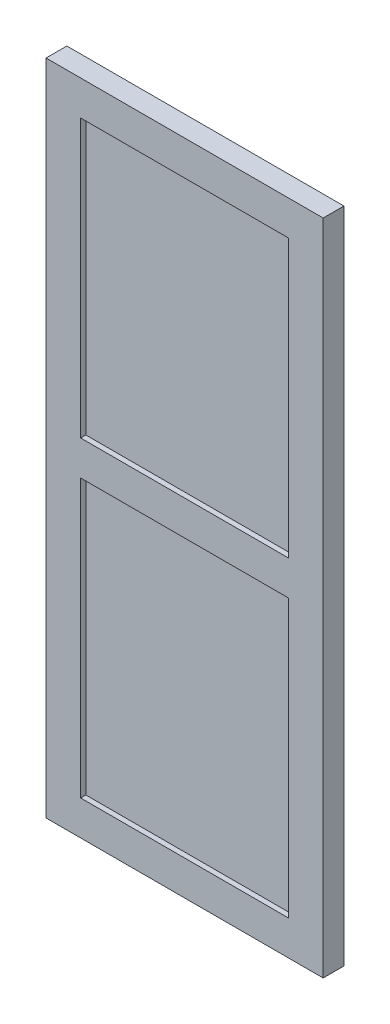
ISO-10303-21;
HEADER;
FILE_DESCRIPTION(('STEP AP214'),'2;1');
FILE_NAME('part.step','',(''),(''),'','','');
FILE_SCHEMA(('AUTOMOTIVE_DESIGN { 1 0 10303 214 1 1 1 1 }'));
ENDSEC;
DATA;
#1=APPLICATION_CONTEXT('core data for automotive mechanical design processes');
#2=APPLICATION_PROTOCOL_DEFINITION('international standard','automotive_design',2000,#1);
#3=PRODUCT_CONTEXT('',#1,'mechanical');
#4=PRODUCT('Part','Part','',(#3));
#5=PRODUCT_RELATED_PRODUCT_CATEGORY('part','',(#4));
#6=PRODUCT_DEFINITION_FORMATION('','',#4);
#7=PRODUCT_DEFINITION_CONTEXT('part definition',#1,'design');
#8=PRODUCT_DEFINITION('design','',#6,#7);
#9=PRODUCT_DEFINITION_SHAPE('','',#8);
#10=(LENGTH_UNIT() NAMED_UNIT(*) SI_UNIT(.MILLI.,.METRE.));
#11=(NAMED_UNIT(*) PLANE_ANGLE_UNIT() SI_UNIT($,.RADIAN.));
#12=(NAMED_UNIT(*) SI_UNIT($,.STERADIAN.) SOLID_ANGLE_UNIT());
#13=UNCERTAINTY_MEASURE_WITH_UNIT(LENGTH_MEASURE(1.E-05),#10,'distance_accuracy_value','');
#14=(GEOMETRIC_REPRESENTATION_CONTEXT(3) GLOBAL_UNCERTAINTY_ASSIGNED_CONTEXT((#13)) GLOBAL_UNIT_ASSIGNED_CONTEXT((#10,
#11,#12)) REPRESENTATION_CONTEXT('',''));
#15=CARTESIAN_POINT('',(0.,0.,0.));
#16=DIRECTION('',(0.,0.,1.));
#17=DIRECTION('',(1.,0.,0.));
#18=AXIS2_PLACEMENT_3D('',#15,#16,#17);
#19=CARTESIAN_POINT('',(111.647727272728,-90.4829545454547,-30.));
#20=DIRECTION('',(1.,0.,0.));
#21=DIRECTION('',(0.,1.,0.));
#22=AXIS2_PLACEMENT_3D('',#19,#20,#21);
#23=PLANE('',#22);
#24=DIRECTION('',(0.,-1.,0.));
#25=VECTOR('',#24,1.);
#26=CARTESIAN_POINT('',(111.647727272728,0.,-15.));
#27=LINE('',#26,#25);
#28=CARTESIAN_POINT('',(111.647727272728,-90.4829545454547,-15.));
#29=VERTEX_POINT('',#28);
#30=CARTESIAN_POINT('',(111.647727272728,-890.482954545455,-15.));
#31=VERTEX_POINT('',#30);
#32=EDGE_CURVE('E355',#29,#31,#27,.T.);
#33=ORIENTED_EDGE('',*,*,#32,.F.);
#34=DIRECTION('',(0.,0.,1.));
#35=VECTOR('',#34,1.);
#36=CARTESIAN_POINT('',(111.647727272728,-90.4829545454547,-30.));
#37=LINE('',#36,#35);
#38=CARTESIAN_POINT('',(111.647727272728,-90.4829545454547,-30.));
#39=VERTEX_POINT('',#38);
#40=EDGE_CURVE('E195',#39,#29,#37,.T.);
#41=ORIENTED_EDGE('',*,*,#40,.F.);
#42=DIRECTION('',(0.,1.,0.));
#43=VECTOR('',#42,1.);
#44=CARTESIAN_POINT('',(111.647727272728,-90.4829545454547,-30.));
#45=LINE('',#44,#43);
#46=CARTESIAN_POINT('',(111.647727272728,-890.482954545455,-30.));
#47=VERTEX_POINT('',#46);
#48=EDGE_CURVE('E274',#47,#39,#45,.T.);
#49=ORIENTED_EDGE('',*,*,#48,.F.);
#50=DIRECTION('',(0.,0.,1.));
#51=VECTOR('',#50,1.);
#52=CARTESIAN_POINT('',(111.647727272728,-890.482954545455,-30.));
#53=LINE('',#52,#51);
#54=EDGE_CURVE('E207',#47,#31,#53,.T.);
#55=ORIENTED_EDGE('',*,*,#54,.T.);
#56=EDGE_LOOP('',(#33,#41,#49,#55));
#57=FACE_BOUND('',#56,.T.);
#58=ADVANCED_FACE('F32',(#57),#23,.F.);
#59=CARTESIAN_POINT('',(-488.352272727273,-890.482954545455,-30.));
#60=DIRECTION('',(0.,-1.,0.));
#61=DIRECTION('',(1.,0.,0.));
#62=AXIS2_PLACEMENT_3D('',#59,#60,#61);
#63=PLANE('',#62);
#64=DIRECTION('',(1.,0.,0.));
#65=VECTOR('',#64,1.);
#66=CARTESIAN_POINT('',(1.64772446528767E-13,-890.482954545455,-15.));
#67=LINE('',#66,#65);
#68=CARTESIAN_POINT('',(-488.352272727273,-890.482954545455,-15.));
#69=VERTEX_POINT('',#68);
#70=EDGE_CURVE('E49',#69,#31,#67,.T.);
#71=ORIENTED_EDGE('',*,*,#70,.T.);
#72=ORIENTED_EDGE('',*,*,#54,.F.);
#73=DIRECTION('',(1.,0.,0.));
#74=VECTOR('',#73,1.);
#75=CARTESIAN_POINT('',(-488.352272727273,-890.482954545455,-30.));
#76=LINE('',#75,#74);
#77=CARTESIAN_POINT('',(-488.352272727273,-890.482954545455,-30.));
#78=VERTEX_POINT('',#77);
#79=EDGE_CURVE('E283',#78,#47,#76,.T.);
#80=ORIENTED_EDGE('',*,*,#79,.F.);
#81=DIRECTION('',(0.,0.,1.));
#82=VECTOR('',#81,1.);
#83=CARTESIAN_POINT('',(-488.352272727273,-890.482954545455,-30.));
#84=LINE('',#83,#82);
#85=EDGE_CURVE('E200',#78,#69,#84,.T.);
#86=ORIENTED_EDGE('',*,*,#85,.T.);
#87=EDGE_LOOP('',(#71,#72,#80,#86));
#88=FACE_BOUND('',#87,.T.);
#89=ADVANCED_FACE('F382',(#88),#63,.F.);
#90=CARTESIAN_POINT('',(-488.352272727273,-90.4829545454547,-30.));
#91=DIRECTION('',(-1.,0.,0.));
#92=DIRECTION('',(0.,0.,1.));
#93=AXIS2_PLACEMENT_3D('',#90,#91,#92);
#94=PLANE('',#93);
#95=DIRECTION('',(0.,-1.,0.));
#96=VECTOR('',#95,1.);
#97=CARTESIAN_POINT('',(-488.352272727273,0.,-15.));
#98=LINE('',#97,#96);
#99=CARTESIAN_POINT('',(-488.352272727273,-90.4829545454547,-15.));
#100=VERTEX_POINT('',#99);
#101=EDGE_CURVE('E57',#100,#69,#98,.T.);
#102=ORIENTED_EDGE('',*,*,#101,.T.);
#103=ORIENTED_EDGE('',*,*,#85,.F.);
#104=DIRECTION('',(0.,-1.,0.));
#105=VECTOR('',#104,1.);
#106=CARTESIAN_POINT('',(-488.352272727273,-90.4829545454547,-30.));
#107=LINE('',#106,#105);
#108=CARTESIAN_POINT('',(-488.352272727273,-90.4829545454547,-30.));
#109=VERTEX_POINT('',#108);
#110=EDGE_CURVE('E280',#109,#78,#107,.T.);
#111=ORIENTED_EDGE('',*,*,#110,.F.);
#112=DIRECTION('',(0.,0.,1.));
#113=VECTOR('',#112,1.);
#114=CARTESIAN_POINT('',(-488.352272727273,-90.4829545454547,-30.));
#115=LINE('',#114,#113);
#116=EDGE_CURVE('E194',#109,#100,#115,.T.);
#117=ORIENTED_EDGE('',*,*,#116,.T.);
#118=EDGE_LOOP('',(#102,#103,#111,#117));
#119=FACE_BOUND('',#118,.T.);
#120=ADVANCED_FACE('F387',(#119),#94,.F.);
#121=CARTESIAN_POINT('',(-488.352272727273,-90.4829545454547,-30.));
#122=DIRECTION('',(0.,1.,0.));
#123=DIRECTION('',(0.,0.,1.));
#124=AXIS2_PLACEMENT_3D('',#121,#122,#123);
#125=PLANE('',#124);
#126=DIRECTION('',(1.,0.,0.));
#127=VECTOR('',#126,1.);
#128=CARTESIAN_POINT('',(0.,-90.4829545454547,-15.));
#129=LINE('',#128,#127);
#130=EDGE_CURVE('E347',#100,#29,#129,.T.);
#131=ORIENTED_EDGE('',*,*,#130,.F.);
#132=ORIENTED_EDGE('',*,*,#116,.F.);
#133=DIRECTION('',(-1.,0.,0.));
#134=VECTOR('',#133,1.);
#135=CARTESIAN_POINT('',(-488.352272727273,-90.4829545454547,-30.));
#136=LINE('',#135,#134);
#137=EDGE_CURVE('E277',#39,#109,#136,.T.);
#138=ORIENTED_EDGE('',*,*,#137,.F.);
#139=ORIENTED_EDGE('',*,*,#40,.T.);
#140=EDGE_LOOP('',(#131,#132,#138,#139));
#141=FACE_BOUND('',#140,.T.);
#142=ADVANCED_FACE('F379',(#141),#125,.F.);
#143=CARTESIAN_POINT('',(-488.352272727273,809.517045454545,-30.));
#144=DIRECTION('',(-1.,0.,0.));
#145=DIRECTION('',(0.,0.,1.));
#146=AXIS2_PLACEMENT_3D('',#143,#144,#145);
#147=PLANE('',#146);
#148=DIRECTION('',(0.,-1.,0.));
#149=VECTOR('',#148,1.);
#150=CARTESIAN_POINT('',(-488.352272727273,0.,-15.));
#151=LINE('',#150,#149);
#152=CARTESIAN_POINT('',(-488.352272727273,809.517045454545,-15.));
#153=VERTEX_POINT('',#152);
#154=CARTESIAN_POINT('',(-488.352272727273,9.51704545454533,-15.));
#155=VERTEX_POINT('',#154);
#156=EDGE_CURVE('E329',#153,#155,#151,.T.);
#157=ORIENTED_EDGE('',*,*,#156,.T.);
#158=DIRECTION('',(0.,0.,1.));
#159=VECTOR('',#158,1.);
#160=CARTESIAN_POINT('',(-488.352272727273,9.51704545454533,-30.));
#161=LINE('',#160,#159);
#162=CARTESIAN_POINT('',(-488.352272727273,9.51704545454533,-30.));
#163=VERTEX_POINT('',#162);
#164=EDGE_CURVE('E230',#163,#155,#161,.T.);
#165=ORIENTED_EDGE('',*,*,#164,.F.);
#166=DIRECTION('',(0.,-1.,0.));
#167=VECTOR('',#166,1.);
#168=CARTESIAN_POINT('',(-488.352272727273,809.517045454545,-30.));
#169=LINE('',#168,#167);
#170=CARTESIAN_POINT('',(-488.352272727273,809.517045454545,-30.));
#171=VERTEX_POINT('',#170);
#172=EDGE_CURVE('E203',#171,#163,#169,.T.);
#173=ORIENTED_EDGE('',*,*,#172,.F.);
#174=DIRECTION('',(0.,0.,1.));
#175=VECTOR('',#174,1.);
#176=CARTESIAN_POINT('',(-488.352272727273,809.517045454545,-30.));
#177=LINE('',#176,#175);
#178=EDGE_CURVE('E217',#171,#153,#177,.T.);
#179=ORIENTED_EDGE('',*,*,#178,.T.);
#180=EDGE_LOOP('',(#157,#165,#173,#179));
#181=FACE_BOUND('',#180,.T.);
#182=ADVANCED_FACE('F368',(#181),#147,.F.);
#183=CARTESIAN_POINT('',(-488.352272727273,809.517045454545,-30.));
#184=DIRECTION('',(0.,1.,0.));
#185=DIRECTION('',(0.,0.,1.));
#186=AXIS2_PLACEMENT_3D('',#183,#184,#185);
#187=PLANE('',#186);
#188=DIRECTION('',(1.,0.,0.));
#189=VECTOR('',#188,1.);
#190=CARTESIAN_POINT('',(0.,809.517045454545,-15.));
#191=LINE('',#190,#189);
#192=CARTESIAN_POINT('',(111.647727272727,809.517045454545,-15.));
#193=VERTEX_POINT('',#192);
#194=EDGE_CURVE('E343',#153,#193,#191,.T.);
#195=ORIENTED_EDGE('',*,*,#194,.F.);
#196=ORIENTED_EDGE('',*,*,#178,.F.);
#197=DIRECTION('',(-1.,0.,0.));
#198=VECTOR('',#197,1.);
#199=CARTESIAN_POINT('',(-488.352272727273,809.517045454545,-30.));
#200=LINE('',#199,#198);
#201=CARTESIAN_POINT('',(111.647727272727,809.517045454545,-30.));
#202=VERTEX_POINT('',#201);
#203=EDGE_CURVE('E213',#202,#171,#200,.T.);
#204=ORIENTED_EDGE('',*,*,#203,.F.);
#205=DIRECTION('',(0.,0.,1.));
#206=VECTOR('',#205,1.);
#207=CARTESIAN_POINT('',(111.647727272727,809.517045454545,-30.));
#208=LINE('',#207,#206);
#209=EDGE_CURVE('E222',#202,#193,#208,.T.);
#210=ORIENTED_EDGE('',*,*,#209,.T.);
#211=EDGE_LOOP('',(#195,#196,#204,#210));
#212=FACE_BOUND('',#211,.T.);
#213=ADVANCED_FACE('F374',(#212),#187,.F.);
#214=CARTESIAN_POINT('',(111.647727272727,809.517045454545,-30.));
#215=DIRECTION('',(1.,0.,0.));
#216=DIRECTION('',(0.,1.,0.));
#217=AXIS2_PLACEMENT_3D('',#214,#215,#216);
#218=PLANE('',#217);
#219=DIRECTION('',(0.,-1.,0.));
#220=VECTOR('',#219,1.);
#221=CARTESIAN_POINT('',(111.647727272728,0.,-15.));
#222=LINE('',#221,#220);
#223=CARTESIAN_POINT('',(111.647727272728,9.51704545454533,-15.));
#224=VERTEX_POINT('',#223);
#225=EDGE_CURVE('E340',#193,#224,#222,.T.);
#226=ORIENTED_EDGE('',*,*,#225,.F.);
#227=ORIENTED_EDGE('',*,*,#209,.F.);
#228=DIRECTION('',(0.,1.,0.));
#229=VECTOR('',#228,1.);
#230=CARTESIAN_POINT('',(111.647727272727,809.517045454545,-30.));
#231=LINE('',#230,#229);
#232=CARTESIAN_POINT('',(111.647727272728,9.51704545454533,-30.));
#233=VERTEX_POINT('',#232);
#234=EDGE_CURVE('E210',#233,#202,#231,.T.);
#235=ORIENTED_EDGE('',*,*,#234,.F.);
#236=DIRECTION('',(0.,0.,1.));
#237=VECTOR('',#236,1.);
#238=CARTESIAN_POINT('',(111.647727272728,9.51704545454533,-30.));
#239=LINE('',#238,#237);
#240=EDGE_CURVE('E226',#233,#224,#239,.T.);
#241=ORIENTED_EDGE('',*,*,#240,.T.);
#242=EDGE_LOOP('',(#226,#227,#235,#241));
#243=FACE_BOUND('',#242,.T.);
#244=ADVANCED_FACE('F400',(#243),#218,.F.);
#245=CARTESIAN_POINT('',(-488.352272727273,9.51704545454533,-30.));
#246=DIRECTION('',(0.,-1.,0.));
#247=DIRECTION('',(1.,0.,0.));
#248=AXIS2_PLACEMENT_3D('',#245,#246,#247);
#249=PLANE('',#248);
#250=DIRECTION('',(1.,0.,0.));
#251=VECTOR('',#250,1.);
#252=CARTESIAN_POINT('',(0.,9.51704545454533,-15.));
#253=LINE('',#252,#251);
#254=EDGE_CURVE('E333',#155,#224,#253,.T.);
#255=ORIENTED_EDGE('',*,*,#254,.T.);
#256=ORIENTED_EDGE('',*,*,#240,.F.);
#257=DIRECTION('',(1.,0.,0.));
#258=VECTOR('',#257,1.);
#259=CARTESIAN_POINT('',(-488.352272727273,9.51704545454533,-30.));
#260=LINE('',#259,#258);
#261=EDGE_CURVE('E206',#163,#233,#260,.T.);
#262=ORIENTED_EDGE('',*,*,#261,.F.);
#263=ORIENTED_EDGE('',*,*,#164,.T.);
#264=EDGE_LOOP('',(#255,#256,#262,#263));
#265=FACE_BOUND('',#264,.T.);
#266=ADVANCED_FACE('F395',(#265),#249,.F.);
#267=CARTESIAN_POINT('',(-588.352272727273,909.517045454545,-30.));
#268=DIRECTION('',(-1.,0.,0.));
#269=DIRECTION('',(0.,0.,1.));
#270=AXIS2_PLACEMENT_3D('',#267,#268,#269);
#271=PLANE('',#270);
#272=DIRECTION('',(0.,0.,1.));
#273=VECTOR('',#272,1.);
#274=CARTESIAN_POINT('',(-588.352272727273,-990.482954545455,-30.));
#275=LINE('',#274,#273);
#276=CARTESIAN_POINT('',(-588.352272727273,-990.482954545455,-30.));
#277=VERTEX_POINT('',#276);
#278=CARTESIAN_POINT('',(-588.352272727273,-990.482954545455,30.));
#279=VERTEX_POINT('',#278);
#280=EDGE_CURVE('E36',#277,#279,#275,.T.);
#281=ORIENTED_EDGE('',*,*,#280,.T.);
#282=DIRECTION('',(0.,-1.,0.));
#283=VECTOR('',#282,1.);
#284=CARTESIAN_POINT('',(-588.352272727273,909.517045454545,30.));
#285=LINE('',#284,#283);
#286=CARTESIAN_POINT('',(-588.352272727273,909.517045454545,30.));
#287=VERTEX_POINT('',#286);
#288=EDGE_CURVE('E250',#287,#279,#285,.T.);
#289=ORIENTED_EDGE('',*,*,#288,.F.);
#290=DIRECTION('',(0.,0.,1.));
#291=VECTOR('',#290,1.);
#292=CARTESIAN_POINT('',(-588.352272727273,909.517045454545,-30.));
#293=LINE('',#292,#291);
#294=CARTESIAN_POINT('',(-588.352272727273,909.517045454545,-30.));
#295=VERTEX_POINT('',#294);
#296=EDGE_CURVE('E11',#295,#287,#293,.T.);
#297=ORIENTED_EDGE('',*,*,#296,.F.);
#298=DIRECTION('',(0.,-1.,0.));
#299=VECTOR('',#298,1.);
#300=CARTESIAN_POINT('',(-588.352272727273,909.517045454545,-30.));
#301=LINE('',#300,#299);
#302=EDGE_CURVE('E220',#295,#277,#301,.T.);
#303=ORIENTED_EDGE('',*,*,#302,.T.);
#304=EDGE_LOOP('',(#281,#289,#297,#303));
#305=FACE_BOUND('',#304,.T.);
#306=ADVANCED_FACE('F34',(#305),#271,.T.);
#307=CARTESIAN_POINT('',(-588.352272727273,909.517045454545,-30.));
#308=DIRECTION('',(0.,1.,0.));
#309=DIRECTION('',(0.,0.,1.));
#310=AXIS2_PLACEMENT_3D('',#307,#308,#309);
#311=PLANE('',#310);
#312=ORIENTED_EDGE('',*,*,#296,.T.);
#313=DIRECTION('',(-1.,0.,0.));
#314=VECTOR('',#313,1.);
#315=CARTESIAN_POINT('',(-588.352272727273,909.517045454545,30.));
#316=LINE('',#315,#314);
#317=CARTESIAN_POINT('',(211.647727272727,909.517045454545,30.));
#318=VERTEX_POINT('',#317);
#319=EDGE_CURVE('E264',#318,#287,#316,.T.);
#320=ORIENTED_EDGE('',*,*,#319,.F.);
#321=DIRECTION('',(0.,0.,1.));
#322=VECTOR('',#321,1.);
#323=CARTESIAN_POINT('',(211.647727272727,909.517045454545,-30.));
#324=LINE('',#323,#322);
#325=CARTESIAN_POINT('',(211.647727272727,909.517045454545,-30.));
#326=VERTEX_POINT('',#325);
#327=EDGE_CURVE('E41',#326,#318,#324,.T.);
#328=ORIENTED_EDGE('',*,*,#327,.F.);
#329=DIRECTION('',(-1.,0.,0.));
#330=VECTOR('',#329,1.);
#331=CARTESIAN_POINT('',(-588.352272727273,909.517045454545,-30.));
#332=LINE('',#331,#330);
#333=EDGE_CURVE('E240',#326,#295,#332,.T.);
#334=ORIENTED_EDGE('',*,*,#333,.T.);
#335=EDGE_LOOP('',(#312,#320,#328,#334));
#336=FACE_BOUND('',#335,.T.);
#337=ADVANCED_FACE('F407',(#336),#311,.T.);
#338=CARTESIAN_POINT('',(211.647727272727,909.517045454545,-30.));
#339=DIRECTION('',(1.,0.,0.));
#340=DIRECTION('',(0.,1.,0.));
#341=AXIS2_PLACEMENT_3D('',#338,#339,#340);
#342=PLANE('',#341);
#343=ORIENTED_EDGE('',*,*,#327,.T.);
#344=DIRECTION('',(0.,1.,0.));
#345=VECTOR('',#344,1.);
#346=CARTESIAN_POINT('',(211.647727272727,909.517045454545,30.));
#347=LINE('',#346,#345);
#348=CARTESIAN_POINT('',(211.647727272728,-990.482954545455,30.));
#349=VERTEX_POINT('',#348);
#350=EDGE_CURVE('E258',#349,#318,#347,.T.);
#351=ORIENTED_EDGE('',*,*,#350,.F.);
#352=DIRECTION('',(0.,0.,1.));
#353=VECTOR('',#352,1.);
#354=CARTESIAN_POINT('',(211.647727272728,-990.482954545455,-30.));
#355=LINE('',#354,#353);
#356=CARTESIAN_POINT('',(211.647727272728,-990.482954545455,-30.));
#357=VERTEX_POINT('',#356);
#358=EDGE_CURVE('E243',#357,#349,#355,.T.);
#359=ORIENTED_EDGE('',*,*,#358,.F.);
#360=DIRECTION('',(0.,1.,0.));
#361=VECTOR('',#360,1.);
#362=CARTESIAN_POINT('',(211.647727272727,909.517045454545,-30.));
#363=LINE('',#362,#361);
#364=EDGE_CURVE('E237',#357,#326,#363,.T.);
#365=ORIENTED_EDGE('',*,*,#364,.T.);
#366=EDGE_LOOP('',(#343,#351,#359,#365));
#367=FACE_BOUND('',#366,.T.);
#368=ADVANCED_FACE('F424',(#367),#342,.T.);
#369=CARTESIAN_POINT('',(-588.352272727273,-990.482954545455,-30.));
#370=DIRECTION('',(0.,-1.,0.));
#371=DIRECTION('',(1.,0.,0.));
#372=AXIS2_PLACEMENT_3D('',#369,#370,#371);
#373=PLANE('',#372);
#374=ORIENTED_EDGE('',*,*,#358,.T.);
#375=DIRECTION('',(1.,0.,0.));
#376=VECTOR('',#375,1.);
#377=CARTESIAN_POINT('',(-588.352272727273,-990.482954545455,30.));
#378=LINE('',#377,#376);
#379=EDGE_CURVE('E253',#279,#349,#378,.T.);
#380=ORIENTED_EDGE('',*,*,#379,.F.);
#381=ORIENTED_EDGE('',*,*,#280,.F.);
#382=DIRECTION('',(1.,0.,0.));
#383=VECTOR('',#382,1.);
#384=CARTESIAN_POINT('',(-588.352272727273,-990.482954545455,-30.));
#385=LINE('',#384,#383);
#386=EDGE_CURVE('E234',#277,#357,#385,.T.);
#387=ORIENTED_EDGE('',*,*,#386,.T.);
#388=EDGE_LOOP('',(#374,#380,#381,#387));
#389=FACE_BOUND('',#388,.T.);
#390=ADVANCED_FACE('F254',(#389),#373,.T.);
#391=CARTESIAN_POINT('',(0.,0.,-30.));
#392=DIRECTION('',(0.,0.,1.));
#393=DIRECTION('',(1.,0.,0.));
#394=AXIS2_PLACEMENT_3D('',#391,#392,#393);
#395=PLANE('',#394);
#396=ORIENTED_EDGE('',*,*,#79,.T.);
#397=ORIENTED_EDGE('',*,*,#48,.T.);
#398=ORIENTED_EDGE('',*,*,#137,.T.);
#399=ORIENTED_EDGE('',*,*,#110,.T.);
#400=EDGE_LOOP('',(#396,#397,#398,#399));
#401=FACE_BOUND('',#400,.T.);
#402=ORIENTED_EDGE('',*,*,#203,.T.);
#403=ORIENTED_EDGE('',*,*,#172,.T.);
#404=ORIENTED_EDGE('',*,*,#261,.T.);
#405=ORIENTED_EDGE('',*,*,#234,.T.);
#406=EDGE_LOOP('',(#402,#403,#404,#405));
#407=FACE_BOUND('',#406,.T.);
#408=ORIENTED_EDGE('',*,*,#302,.F.);
#409=ORIENTED_EDGE('',*,*,#333,.F.);
#410=ORIENTED_EDGE('',*,*,#364,.F.);
#411=ORIENTED_EDGE('',*,*,#386,.F.);
#412=EDGE_LOOP('',(#408,#409,#410,#411));
#413=FACE_BOUND('',#412,.T.);
#414=ADVANCED_FACE('F366',(#401,#407,#413),#395,.F.);
#415=CARTESIAN_POINT('',(-488.352272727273,9.51704545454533,15.));
#416=VERTEX_POINT('',#415);
#417=CARTESIAN_POINT('',(-488.352272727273,9.51704545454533,30.));
#418=VERTEX_POINT('',#417);
#419=EDGE_CURVE('E216',#416,#418,#161,.T.);
#420=ORIENTED_EDGE('',*,*,#419,.F.);
#421=DIRECTION('',(0.,-1.,0.));
#422=VECTOR('',#421,1.);
#423=CARTESIAN_POINT('',(-488.352272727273,0.,15.));
#424=LINE('',#423,#422);
#425=CARTESIAN_POINT('',(-488.352272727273,809.517045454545,15.));
#426=VERTEX_POINT('',#425);
#427=EDGE_CURVE('E357',#426,#416,#424,.T.);
#428=ORIENTED_EDGE('',*,*,#427,.F.);
#429=CARTESIAN_POINT('',(-488.352272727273,809.517045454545,30.));
#430=VERTEX_POINT('',#429);
#431=EDGE_CURVE('E221',#426,#430,#177,.T.);
#432=ORIENTED_EDGE('',*,*,#431,.T.);
#433=DIRECTION('',(0.,-1.,0.));
#434=VECTOR('',#433,1.);
#435=CARTESIAN_POINT('',(-488.352272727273,809.517045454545,30.));
#436=LINE('',#435,#434);
#437=EDGE_CURVE('E304',#430,#418,#436,.T.);
#438=ORIENTED_EDGE('',*,*,#437,.T.);
#439=EDGE_LOOP('',(#420,#428,#432,#438));
#440=FACE_BOUND('',#439,.T.);
#441=ADVANCED_FACE('F364',(#440),#147,.F.);
#442=ORIENTED_EDGE('',*,*,#431,.F.);
#443=DIRECTION('',(1.,0.,0.));
#444=VECTOR('',#443,1.);
#445=CARTESIAN_POINT('',(0.,809.517045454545,15.));
#446=LINE('',#445,#444);
#447=CARTESIAN_POINT('',(111.647727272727,809.517045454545,15.));
#448=VERTEX_POINT('',#447);
#449=EDGE_CURVE('E326',#426,#448,#446,.T.);
#450=ORIENTED_EDGE('',*,*,#449,.T.);
#451=CARTESIAN_POINT('',(111.647727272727,809.517045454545,30.));
#452=VERTEX_POINT('',#451);
#453=EDGE_CURVE('E225',#448,#452,#208,.T.);
#454=ORIENTED_EDGE('',*,*,#453,.T.);
#455=DIRECTION('',(-1.,0.,0.));
#456=VECTOR('',#455,1.);
#457=CARTESIAN_POINT('',(-488.352272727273,809.517045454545,30.));
#458=LINE('',#457,#456);
#459=EDGE_CURVE('E265',#452,#430,#458,.T.);
#460=ORIENTED_EDGE('',*,*,#459,.T.);
#461=EDGE_LOOP('',(#442,#450,#454,#460));
#462=FACE_BOUND('',#461,.T.);
#463=ADVANCED_FACE('F324',(#462),#187,.F.);
#464=ORIENTED_EDGE('',*,*,#453,.F.);
#465=DIRECTION('',(0.,-1.,0.));
#466=VECTOR('',#465,1.);
#467=CARTESIAN_POINT('',(111.647727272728,0.,15.));
#468=LINE('',#467,#466);
#469=CARTESIAN_POINT('',(111.647727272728,9.51704545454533,15.));
#470=VERTEX_POINT('',#469);
#471=EDGE_CURVE('E330',#448,#470,#468,.T.);
#472=ORIENTED_EDGE('',*,*,#471,.T.);
#473=CARTESIAN_POINT('',(111.647727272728,9.51704545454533,30.));
#474=VERTEX_POINT('',#473);
#475=EDGE_CURVE('E229',#470,#474,#239,.T.);
#476=ORIENTED_EDGE('',*,*,#475,.T.);
#477=DIRECTION('',(0.,1.,0.));
#478=VECTOR('',#477,1.);
#479=CARTESIAN_POINT('',(111.647727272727,809.517045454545,30.));
#480=LINE('',#479,#478);
#481=EDGE_CURVE('E268',#474,#452,#480,.T.);
#482=ORIENTED_EDGE('',*,*,#481,.T.);
#483=EDGE_LOOP('',(#464,#472,#476,#482));
#484=FACE_BOUND('',#483,.T.);
#485=ADVANCED_FACE('F317',(#484),#218,.F.);
#486=ORIENTED_EDGE('',*,*,#475,.F.);
#487=DIRECTION('',(1.,0.,0.));
#488=VECTOR('',#487,1.);
#489=CARTESIAN_POINT('',(0.,9.51704545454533,15.));
#490=LINE('',#489,#488);
#491=EDGE_CURVE('E335',#416,#470,#490,.T.);
#492=ORIENTED_EDGE('',*,*,#491,.F.);
#493=ORIENTED_EDGE('',*,*,#419,.T.);
#494=DIRECTION('',(1.,0.,0.));
#495=VECTOR('',#494,1.);
#496=CARTESIAN_POINT('',(-488.352272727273,9.51704545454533,30.));
#497=LINE('',#496,#495);
#498=EDGE_CURVE('E307',#418,#474,#497,.T.);
#499=ORIENTED_EDGE('',*,*,#498,.T.);
#500=EDGE_LOOP('',(#486,#492,#493,#499));
#501=FACE_BOUND('',#500,.T.);
#502=ADVANCED_FACE('F362',(#501),#249,.F.);
#503=CARTESIAN_POINT('',(111.647727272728,-90.4829545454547,15.));
#504=VERTEX_POINT('',#503);
#505=CARTESIAN_POINT('',(111.647727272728,-90.4829545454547,30.));
#506=VERTEX_POINT('',#505);
#507=EDGE_CURVE('E197',#504,#506,#37,.T.);
#508=ORIENTED_EDGE('',*,*,#507,.F.);
#509=DIRECTION('',(0.,-1.,0.));
#510=VECTOR('',#509,1.);
#511=CARTESIAN_POINT('',(111.647727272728,0.,15.));
#512=LINE('',#511,#510);
#513=CARTESIAN_POINT('',(111.647727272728,-890.482954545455,15.));
#514=VERTEX_POINT('',#513);
#515=EDGE_CURVE('E176',#504,#514,#512,.T.);
#516=ORIENTED_EDGE('',*,*,#515,.T.);
#517=CARTESIAN_POINT('',(111.647727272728,-890.482954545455,30.));
#518=VERTEX_POINT('',#517);
#519=EDGE_CURVE('E285',#514,#518,#53,.T.);
#520=ORIENTED_EDGE('',*,*,#519,.T.);
#521=DIRECTION('',(0.,1.,0.));
#522=VECTOR('',#521,1.);
#523=CARTESIAN_POINT('',(111.647727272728,-90.4829545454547,30.));
#524=LINE('',#523,#522);
#525=EDGE_CURVE('E303',#518,#506,#524,.T.);
#526=ORIENTED_EDGE('',*,*,#525,.T.);
#527=EDGE_LOOP('',(#508,#516,#520,#526));
#528=FACE_BOUND('',#527,.T.);
#529=ADVANCED_FACE('F346',(#528),#23,.F.);
#530=ORIENTED_EDGE('',*,*,#519,.F.);
#531=DIRECTION('',(1.,0.,0.));
#532=VECTOR('',#531,1.);
#533=CARTESIAN_POINT('',(1.64772446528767E-13,-890.482954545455,15.));
#534=LINE('',#533,#532);
#535=CARTESIAN_POINT('',(-488.352272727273,-890.482954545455,15.));
#536=VERTEX_POINT('',#535);
#537=EDGE_CURVE('E188',#536,#514,#534,.T.);
#538=ORIENTED_EDGE('',*,*,#537,.F.);
#539=CARTESIAN_POINT('',(-488.352272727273,-890.482954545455,30.));
#540=VERTEX_POINT('',#539);
#541=EDGE_CURVE('E187',#536,#540,#84,.T.);
#542=ORIENTED_EDGE('',*,*,#541,.T.);
#543=DIRECTION('',(1.,0.,0.));
#544=VECTOR('',#543,1.);
#545=CARTESIAN_POINT('',(-488.352272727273,-890.482954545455,30.));
#546=LINE('',#545,#544);
#547=EDGE_CURVE('E298',#540,#518,#546,.T.);
#548=ORIENTED_EDGE('',*,*,#547,.T.);
#549=EDGE_LOOP('',(#530,#538,#542,#548));
#550=FACE_BOUND('',#549,.T.);
#551=ADVANCED_FACE('F296',(#550),#63,.F.);
#552=ORIENTED_EDGE('',*,*,#541,.F.);
#553=DIRECTION('',(0.,-1.,0.));
#554=VECTOR('',#553,1.);
#555=CARTESIAN_POINT('',(-488.352272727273,0.,15.));
#556=LINE('',#555,#554);
#557=CARTESIAN_POINT('',(-488.352272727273,-90.4829545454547,15.));
#558=VERTEX_POINT('',#557);
#559=EDGE_CURVE('E173',#558,#536,#556,.T.);
#560=ORIENTED_EDGE('',*,*,#559,.F.);
#561=CARTESIAN_POINT('',(-488.352272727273,-90.4829545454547,30.));
#562=VERTEX_POINT('',#561);
#563=EDGE_CURVE('E185',#558,#562,#115,.T.);
#564=ORIENTED_EDGE('',*,*,#563,.T.);
#565=DIRECTION('',(0.,-1.,0.));
#566=VECTOR('',#565,1.);
#567=CARTESIAN_POINT('',(-488.352272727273,-90.4829545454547,30.));
#568=LINE('',#567,#566);
#569=EDGE_CURVE('E300',#562,#540,#568,.T.);
#570=ORIENTED_EDGE('',*,*,#569,.T.);
#571=EDGE_LOOP('',(#552,#560,#564,#570));
#572=FACE_BOUND('',#571,.T.);
#573=ADVANCED_FACE('F183',(#572),#94,.F.);
#574=ORIENTED_EDGE('',*,*,#563,.F.);
#575=DIRECTION('',(1.,0.,0.));
#576=VECTOR('',#575,1.);
#577=CARTESIAN_POINT('',(0.,-90.4829545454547,15.));
#578=LINE('',#577,#576);
#579=EDGE_CURVE('E170',#558,#504,#578,.T.);
#580=ORIENTED_EDGE('',*,*,#579,.T.);
#581=ORIENTED_EDGE('',*,*,#507,.T.);
#582=DIRECTION('',(-1.,0.,0.));
#583=VECTOR('',#582,1.);
#584=CARTESIAN_POINT('',(-488.352272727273,-90.4829545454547,30.));
#585=LINE('',#584,#583);
#586=EDGE_CURVE('E192',#506,#562,#585,.T.);
#587=ORIENTED_EDGE('',*,*,#586,.T.);
#588=EDGE_LOOP('',(#574,#580,#581,#587));
#589=FACE_BOUND('',#588,.T.);
#590=ADVANCED_FACE('F190',(#589),#125,.F.);
#591=CARTESIAN_POINT('',(0.,0.,30.));
#592=DIRECTION('',(0.,0.,1.));
#593=DIRECTION('',(1.,0.,0.));
#594=AXIS2_PLACEMENT_3D('',#591,#592,#593);
#595=PLANE('',#594);
#596=ORIENTED_EDGE('',*,*,#288,.T.);
#597=ORIENTED_EDGE('',*,*,#379,.T.);
#598=ORIENTED_EDGE('',*,*,#350,.T.);
#599=ORIENTED_EDGE('',*,*,#319,.T.);
#600=EDGE_LOOP('',(#596,#597,#598,#599));
#601=FACE_BOUND('',#600,.T.);
#602=ORIENTED_EDGE('',*,*,#498,.F.);
#603=ORIENTED_EDGE('',*,*,#437,.F.);
#604=ORIENTED_EDGE('',*,*,#459,.F.);
#605=ORIENTED_EDGE('',*,*,#481,.F.);
#606=EDGE_LOOP('',(#602,#603,#604,#605));
#607=FACE_BOUND('',#606,.T.);
#608=ORIENTED_EDGE('',*,*,#586,.F.);
#609=ORIENTED_EDGE('',*,*,#525,.F.);
#610=ORIENTED_EDGE('',*,*,#547,.F.);
#611=ORIENTED_EDGE('',*,*,#569,.F.);
#612=EDGE_LOOP('',(#608,#609,#610,#611));
#613=FACE_BOUND('',#612,.T.);
#614=ADVANCED_FACE('F261',(#601,#607,#613),#595,.T.);
#615=CARTESIAN_POINT('',(0.,0.,15.));
#616=DIRECTION('',(0.,0.,1.));
#617=DIRECTION('',(1.,0.,0.));
#618=AXIS2_PLACEMENT_3D('',#615,#616,#617);
#619=PLANE('',#618);
#620=ORIENTED_EDGE('',*,*,#427,.T.);
#621=ORIENTED_EDGE('',*,*,#491,.T.);
#622=ORIENTED_EDGE('',*,*,#471,.F.);
#623=ORIENTED_EDGE('',*,*,#449,.F.);
#624=EDGE_LOOP('',(#620,#621,#622,#623));
#625=FACE_BOUND('',#624,.T.);
#626=ADVANCED_FACE('F359',(#625),#619,.T.);
#627=CARTESIAN_POINT('',(0.,0.,-15.));
#628=DIRECTION('',(0.,0.,1.));
#629=DIRECTION('',(1.,0.,0.));
#630=AXIS2_PLACEMENT_3D('',#627,#628,#629);
#631=PLANE('',#630);
#632=ORIENTED_EDGE('',*,*,#156,.F.);
#633=ORIENTED_EDGE('',*,*,#194,.T.);
#634=ORIENTED_EDGE('',*,*,#225,.T.);
#635=ORIENTED_EDGE('',*,*,#254,.F.);
#636=EDGE_LOOP('',(#632,#633,#634,#635));
#637=FACE_BOUND('',#636,.T.);
#638=ADVANCED_FACE('F414',(#637),#631,.F.);
#639=CARTESIAN_POINT('',(0.,0.,15.));
#640=DIRECTION('',(0.,0.,1.));
#641=DIRECTION('',(1.,0.,0.));
#642=AXIS2_PLACEMENT_3D('',#639,#640,#641);
#643=PLANE('',#642);
#644=ORIENTED_EDGE('',*,*,#579,.F.);
#645=ORIENTED_EDGE('',*,*,#559,.T.);
#646=ORIENTED_EDGE('',*,*,#537,.T.);
#647=ORIENTED_EDGE('',*,*,#515,.F.);
#648=EDGE_LOOP('',(#644,#645,#646,#647));
#649=FACE_BOUND('',#648,.T.);
#650=ADVANCED_FACE('F172',(#649),#643,.T.);
#651=CARTESIAN_POINT('',(0.,0.,-15.));
#652=DIRECTION('',(0.,0.,1.));
#653=DIRECTION('',(1.,0.,0.));
#654=AXIS2_PLACEMENT_3D('',#651,#652,#653);
#655=PLANE('',#654);
#656=ORIENTED_EDGE('',*,*,#130,.T.);
#657=ORIENTED_EDGE('',*,*,#32,.T.);
#658=ORIENTED_EDGE('',*,*,#70,.F.);
#659=ORIENTED_EDGE('',*,*,#101,.F.);
#660=EDGE_LOOP('',(#656,#657,#658,#659));
#661=FACE_BOUND('',#660,.T.);
#662=ADVANCED_FACE('F567',(#661),#655,.F.);
#663=CLOSED_SHELL('',(#58,#89,#120,#142,#182,#213,#244,#266,#306,#337,#368,#390,#414,#441,#463,
#485,#502,#529,#551,#573,#590,#614,#626,#638,#650,#662));
#664=MANIFOLD_SOLID_BREP('B2',#663);
#665=ADVANCED_BREP_SHAPE_REPRESENTATION('',(#18,#664),#14);
#666=SHAPE_DEFINITION_REPRESENTATION(#9,#665);
ENDSEC;
END-ISO-10303-21;
